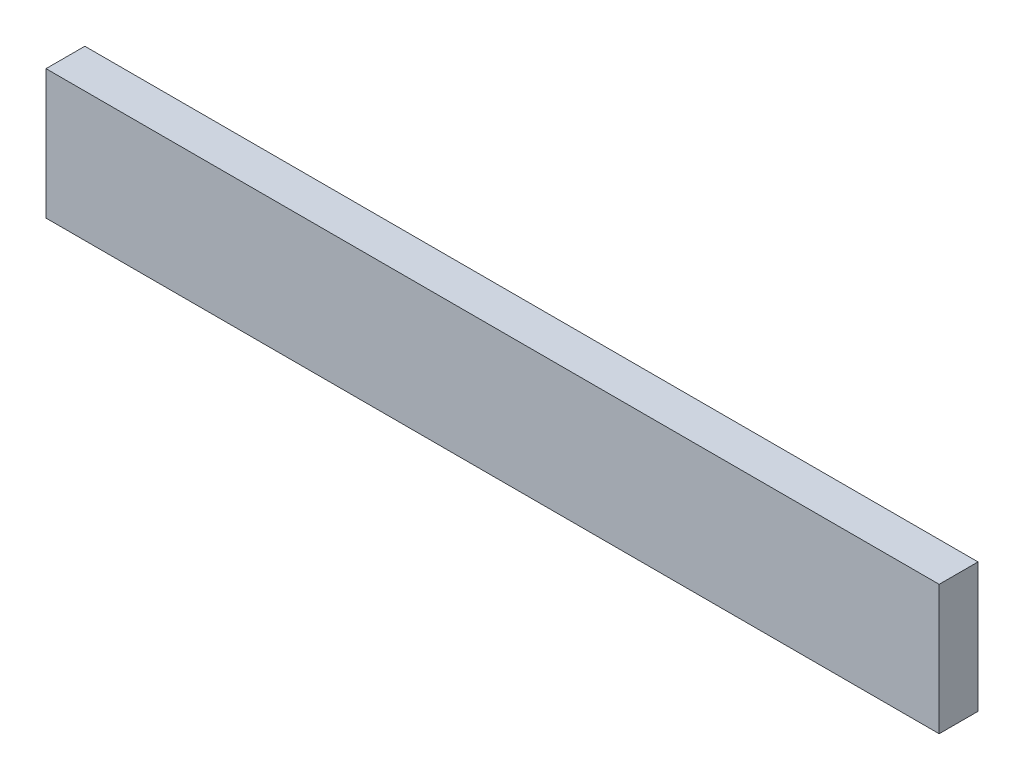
from build123d import *

# Parameters (mm, degrees)
ESQUISSE1_W        = 414
ESQUISSE1_H        = 60
BOSS_EXTRU_1_DEPTH = 18


with BuildPart() as part:
    # Esquisse1 → Boss.-Extru.1 (new body)
    with BuildSketch(Plane.XY):
        Rectangle(ESQUISSE1_W, ESQUISSE1_H)
    extrude(amount=BOSS_EXTRU_1_DEPTH)


solid = part.part
